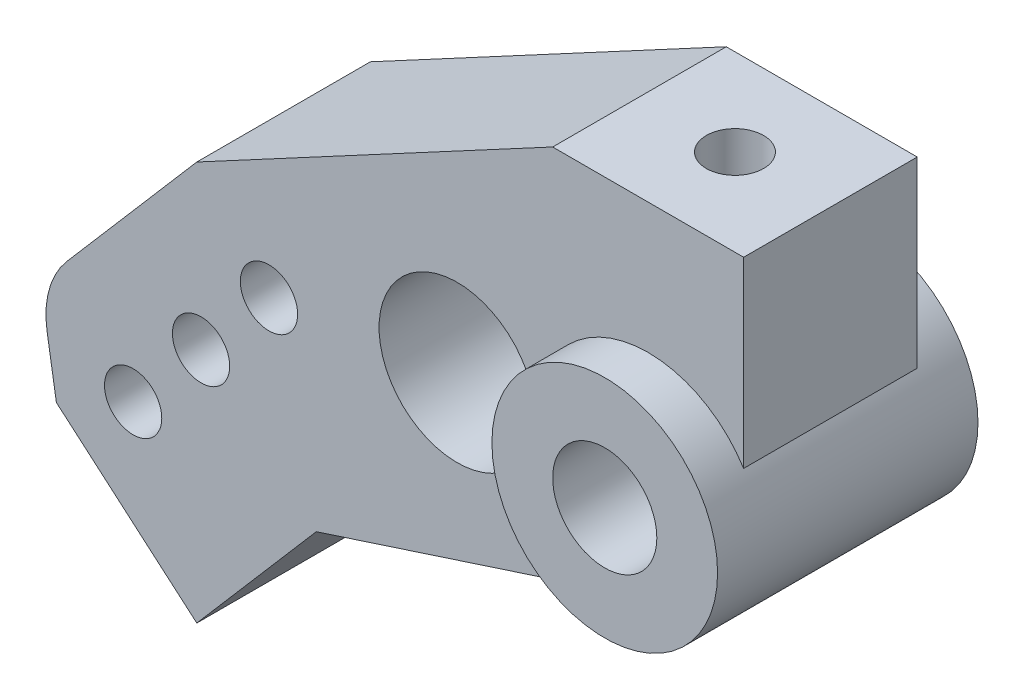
ISO-10303-21;
HEADER;
FILE_DESCRIPTION(('STEP AP214'),'2;1');
FILE_NAME('part.step','',(''),(''),'','','');
FILE_SCHEMA(('AUTOMOTIVE_DESIGN { 1 0 10303 214 1 1 1 1 }'));
ENDSEC;
DATA;
#1=APPLICATION_CONTEXT('core data for automotive mechanical design processes');
#2=APPLICATION_PROTOCOL_DEFINITION('international standard','automotive_design',2000,#1);
#3=PRODUCT_CONTEXT('',#1,'mechanical');
#4=PRODUCT('Part','Part','',(#3));
#5=PRODUCT_RELATED_PRODUCT_CATEGORY('part','',(#4));
#6=PRODUCT_DEFINITION_FORMATION('','',#4);
#7=PRODUCT_DEFINITION_CONTEXT('part definition',#1,'design');
#8=PRODUCT_DEFINITION('design','',#6,#7);
#9=PRODUCT_DEFINITION_SHAPE('','',#8);
#10=(LENGTH_UNIT() NAMED_UNIT(*) SI_UNIT(.MILLI.,.METRE.));
#11=(NAMED_UNIT(*) PLANE_ANGLE_UNIT() SI_UNIT($,.RADIAN.));
#12=(NAMED_UNIT(*) SI_UNIT($,.STERADIAN.) SOLID_ANGLE_UNIT());
#13=UNCERTAINTY_MEASURE_WITH_UNIT(LENGTH_MEASURE(1.E-05),#10,'distance_accuracy_value','');
#14=(GEOMETRIC_REPRESENTATION_CONTEXT(3) GLOBAL_UNCERTAINTY_ASSIGNED_CONTEXT((#13)) GLOBAL_UNIT_ASSIGNED_CONTEXT((#10,
#11,#12)) REPRESENTATION_CONTEXT('',''));
#15=CARTESIAN_POINT('',(0.,0.,0.));
#16=DIRECTION('',(0.,0.,1.));
#17=DIRECTION('',(1.,0.,0.));
#18=AXIS2_PLACEMENT_3D('',#15,#16,#17);
#19=CARTESIAN_POINT('',(0.,0.,-9.));
#20=DIRECTION('',(0.,0.,1.));
#21=DIRECTION('',(1.,0.,0.));
#22=AXIS2_PLACEMENT_3D('',#19,#20,#21);
#23=CYLINDRICAL_SURFACE('',#22,3.);
#24=CARTESIAN_POINT('',(0.,0.,-7.5));
#25=DIRECTION('',(0.,0.,1.));
#26=DIRECTION('',(1.,0.,0.));
#27=AXIS2_PLACEMENT_3D('',#24,#25,#26);
#28=CIRCLE('',#27,3.);
#29=CARTESIAN_POINT('',(3.,0.,-7.5));
#30=VERTEX_POINT('',#29);
#31=EDGE_CURVE('E212',#30,#30,#28,.F.);
#32=ORIENTED_EDGE('',*,*,#31,.T.);
#33=EDGE_LOOP('',(#32));
#34=FACE_BOUND('',#33,.T.);
#35=CARTESIAN_POINT('',(1.65,2.50549396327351,0.));
#36=CARTESIAN_POINT('',(1.64999602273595,2.50549963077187,-0.0846080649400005));
#37=CARTESIAN_POINT('',(1.64345134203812,2.50984420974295,-0.169248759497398));
#38=CARTESIAN_POINT('',(1.61767296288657,2.52653030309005,-0.335794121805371));
#39=CARTESIAN_POINT('',(1.59842443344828,2.53888116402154,-0.417695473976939));
#40=CARTESIAN_POINT('',(1.54839265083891,2.56969421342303,-0.576056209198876));
#41=CARTESIAN_POINT('',(1.51767883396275,2.58811953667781,-0.652545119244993));
#42=CARTESIAN_POINT('',(1.44580739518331,2.62894375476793,-0.799263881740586));
#43=CARTESIAN_POINT('',(1.40464664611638,2.65134383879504,-0.86949185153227));
#44=CARTESIAN_POINT('',(1.3081895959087,2.70034240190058,-1.0094935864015));
#45=CARTESIAN_POINT('',(1.25188532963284,2.7271364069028,-1.0785046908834));
#46=CARTESIAN_POINT('',(1.12882172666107,2.78033433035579,-1.20671606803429));
#47=CARTESIAN_POINT('',(1.06205629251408,2.80673801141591,-1.26591057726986));
#48=CARTESIAN_POINT('',(0.912983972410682,2.85888257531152,-1.37781284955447));
#49=CARTESIAN_POINT('',(0.829834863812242,2.88437187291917,-1.42952718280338));
#50=CARTESIAN_POINT('',(0.654349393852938,2.92916380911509,-1.51787796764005));
#51=CARTESIAN_POINT('',(0.562020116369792,2.94847117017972,-1.55452593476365));
#52=CARTESIAN_POINT('',(0.378923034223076,2.97729379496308,-1.60849393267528));
#53=CARTESIAN_POINT('',(0.288664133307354,2.98748996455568,-1.62716806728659));
#54=CARTESIAN_POINT('',(0.105769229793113,2.99953119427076,-1.6491747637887));
#55=CARTESIAN_POINT('',(0.013135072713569,3.00138255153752,-1.65251889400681));
#56=CARTESIAN_POINT('',(-0.161457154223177,2.99679125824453,-1.6441598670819));
#57=CARTESIAN_POINT('',(-0.243517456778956,2.99119677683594,-1.63399564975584));
#58=CARTESIAN_POINT('',(-0.404549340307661,2.97370133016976,-1.60174374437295));
#59=CARTESIAN_POINT('',(-0.483520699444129,2.9617999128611,-1.57965520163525));
#60=CARTESIAN_POINT('',(-0.63727968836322,2.93258787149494,-1.52418232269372));
#61=CARTESIAN_POINT('',(-0.712013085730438,2.915220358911,-1.49067886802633));
#62=CARTESIAN_POINT('',(-0.854942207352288,2.87655407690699,-1.41356821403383));
#63=CARTESIAN_POINT('',(-0.923135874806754,2.85525407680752,-1.36995785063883));
#64=CARTESIAN_POINT('',(-1.05891254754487,2.80791974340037,-1.26851887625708));
#65=CARTESIAN_POINT('',(-1.12563747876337,2.78162257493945,-1.2096643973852));
#66=CARTESIAN_POINT('',(-1.24878655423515,2.72855986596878,-1.08208395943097));
#67=CARTESIAN_POINT('',(-1.30519861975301,2.70179381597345,-1.01334659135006));
#68=CARTESIAN_POINT('',(-1.41107411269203,2.64814890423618,-0.860666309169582));
#69=CARTESIAN_POINT('',(-1.45948497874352,2.62146854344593,-0.775916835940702));
#70=CARTESIAN_POINT('',(-1.54099433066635,2.57440711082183,-0.59780951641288));
#71=CARTESIAN_POINT('',(-1.57412522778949,2.55401273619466,-0.504470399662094));
#72=CARTESIAN_POINT('',(-1.61559572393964,2.52789315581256,-0.342076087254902));
#73=CARTESIAN_POINT('',(-1.62845002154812,2.51957413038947,-0.274571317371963));
#74=CARTESIAN_POINT('',(-1.64565179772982,2.50837349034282,-0.138051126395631));
#75=CARTESIAN_POINT('',(-1.65000324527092,2.50548933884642,-0.0690364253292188));
#76=CARTESIAN_POINT('',(-1.64999602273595,2.50549963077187,0.0846080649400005));
#77=CARTESIAN_POINT('',(-1.64345134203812,2.50984420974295,0.169248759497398));
#78=CARTESIAN_POINT('',(-1.61767296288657,2.52653030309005,0.335794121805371));
#79=CARTESIAN_POINT('',(-1.59842443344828,2.53888116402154,0.417695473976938));
#80=CARTESIAN_POINT('',(-1.54839265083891,2.56969421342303,0.576056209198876));
#81=CARTESIAN_POINT('',(-1.51767883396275,2.58811953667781,0.652545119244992));
#82=CARTESIAN_POINT('',(-1.44580739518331,2.62894375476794,0.799263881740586));
#83=CARTESIAN_POINT('',(-1.40464664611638,2.65134383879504,0.86949185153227));
#84=CARTESIAN_POINT('',(-1.3081895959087,2.70034240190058,1.0094935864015));
#85=CARTESIAN_POINT('',(-1.25188532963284,2.7271364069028,1.0785046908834));
#86=CARTESIAN_POINT('',(-1.12882172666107,2.78033433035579,1.20671606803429));
#87=CARTESIAN_POINT('',(-1.06205629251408,2.80673801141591,1.26591057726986));
#88=CARTESIAN_POINT('',(-0.912983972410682,2.85888257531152,1.37781284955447));
#89=CARTESIAN_POINT('',(-0.829834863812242,2.88437187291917,1.42952718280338));
#90=CARTESIAN_POINT('',(-0.654349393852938,2.92916380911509,1.51787796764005));
#91=CARTESIAN_POINT('',(-0.562020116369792,2.94847117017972,1.55452593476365));
#92=CARTESIAN_POINT('',(-0.378923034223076,2.97729379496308,1.60849393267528));
#93=CARTESIAN_POINT('',(-0.288664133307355,2.98748996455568,1.62716806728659));
#94=CARTESIAN_POINT('',(-0.105769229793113,2.99953119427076,1.6491747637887));
#95=CARTESIAN_POINT('',(-0.0131350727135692,3.00138255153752,1.65251889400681));
#96=CARTESIAN_POINT('',(0.161457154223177,2.99679125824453,1.6441598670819));
#97=CARTESIAN_POINT('',(0.243517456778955,2.99119677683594,1.63399564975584));
#98=CARTESIAN_POINT('',(0.40454934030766,2.97370133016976,1.60174374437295));
#99=CARTESIAN_POINT('',(0.483520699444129,2.9617999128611,1.57965520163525));
#100=CARTESIAN_POINT('',(0.63727968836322,2.93258787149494,1.52418232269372));
#101=CARTESIAN_POINT('',(0.712013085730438,2.915220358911,1.49067886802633));
#102=CARTESIAN_POINT('',(0.854942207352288,2.87655407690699,1.41356821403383));
#103=CARTESIAN_POINT('',(0.923135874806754,2.85525407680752,1.36995785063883));
#104=CARTESIAN_POINT('',(1.05891254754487,2.80791974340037,1.26851887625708));
#105=CARTESIAN_POINT('',(1.12563747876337,2.78162257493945,1.2096643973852));
#106=CARTESIAN_POINT('',(1.24878655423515,2.72855986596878,1.08208395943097));
#107=CARTESIAN_POINT('',(1.30519861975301,2.70179381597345,1.01334659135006));
#108=CARTESIAN_POINT('',(1.41107411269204,2.64814890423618,0.860666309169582));
#109=CARTESIAN_POINT('',(1.45948497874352,2.62146854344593,0.775916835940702));
#110=CARTESIAN_POINT('',(1.54099433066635,2.57440711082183,0.59780951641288));
#111=CARTESIAN_POINT('',(1.57412522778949,2.55401273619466,0.504470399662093));
#112=CARTESIAN_POINT('',(1.61559572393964,2.52789315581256,0.342076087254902));
#113=CARTESIAN_POINT('',(1.62845002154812,2.51957413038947,0.274571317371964));
#114=CARTESIAN_POINT('',(1.64565179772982,2.50837349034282,0.138051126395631));
#115=CARTESIAN_POINT('',(1.65000324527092,2.50548933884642,0.069036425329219));
#116=CARTESIAN_POINT('',(1.65,2.50549396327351,0.));
#117=B_SPLINE_CURVE_WITH_KNOTS('',3,(#35,#36,#37,#38,#39,#40,#41,#42,#43,#44,#45,#46,#47,#48,
#49,#50,#51,#52,#53,#54,#55,#56,#57,#58,#59,#60,#61,#62,#63,#64,#65,#66,#67,#68,#69,#70,#71,#72,
#73,#74,#75,#76,#77,#78,#79,#80,#81,#82,#83,#84,#85,#86,#87,#88,#89,#90,#91,#92,#93,#94,#95,#96,
#97,#98,#99,#100,#101,#102,#103,#104,#105,#106,#107,#108,#109,#110,#111,#112,#113,#114,#115,
#116),.UNSPECIFIED.,.T.,.F.,(4,2,2,2,2,2,2,2,2,2,2,2,2,2,2,2,2,2,2,2,2,2,2,2,2,2,2,2,2,2,2,2,2,
2,2,2,2,2,2,2,4),(0.,0.253537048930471,0.50737061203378,0.7596912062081,1.0120874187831,
1.28998237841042,1.56803992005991,1.86997314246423,2.17167516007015,2.44828228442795,
2.7246806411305,2.97213724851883,3.21961159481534,3.46975180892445,3.71997043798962,
3.99715899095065,4.27467014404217,4.57667171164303,4.87802970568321,5.08500131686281,
5.29187629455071,5.54541334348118,5.79924690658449,6.0515675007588,6.3039637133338,
6.58185867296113,6.85991621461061,7.16184943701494,7.46355145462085,7.74015857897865,
8.01655693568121,8.26401354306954,8.51148788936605,8.76162810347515,9.01184673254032,
9.28903528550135,9.56654643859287,9.86854800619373,10.1699060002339,10.3768776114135,
10.5837525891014),.UNSPECIFIED.);
#118=CARTESIAN_POINT('',(1.65,2.50549396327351,0.));
#119=VERTEX_POINT('',#118);
#120=EDGE_CURVE('E117',#119,#119,#117,.T.);
#121=ORIENTED_EDGE('',*,*,#120,.T.);
#122=EDGE_LOOP('',(#121));
#123=FACE_BOUND('',#122,.T.);
#124=CARTESIAN_POINT('',(0.,0.,7.5));
#125=DIRECTION('',(0.,0.,1.));
#126=DIRECTION('',(1.,0.,0.));
#127=AXIS2_PLACEMENT_3D('',#124,#125,#126);
#128=CIRCLE('',#127,3.);
#129=CARTESIAN_POINT('',(3.,0.,7.5));
#130=VERTEX_POINT('',#129);
#131=EDGE_CURVE('E20',#130,#130,#128,.F.);
#132=ORIENTED_EDGE('',*,*,#131,.F.);
#133=EDGE_LOOP('',(#132));
#134=FACE_BOUND('',#133,.T.);
#135=ADVANCED_FACE('F16',(#34,#123,#134),#23,.F.);
#136=CARTESIAN_POINT('',(0.,0.,7.5));
#137=DIRECTION('',(0.,0.,1.));
#138=DIRECTION('',(1.,0.,0.));
#139=AXIS2_PLACEMENT_3D('',#136,#137,#138);
#140=PLANE('',#139);
#141=ORIENTED_EDGE('',*,*,#131,.T.);
#142=EDGE_LOOP('',(#141));
#143=FACE_BOUND('',#142,.T.);
#144=CARTESIAN_POINT('',(0.,0.,7.5));
#145=DIRECTION('',(0.,0.,1.));
#146=DIRECTION('',(1.,0.,0.));
#147=AXIS2_PLACEMENT_3D('',#144,#145,#146);
#148=CIRCLE('',#147,6.5);
#149=CARTESIAN_POINT('',(6.5,0.,7.5));
#150=VERTEX_POINT('',#149);
#151=EDGE_CURVE('E195',#150,#150,#148,.F.);
#152=ORIENTED_EDGE('',*,*,#151,.F.);
#153=EDGE_LOOP('',(#152));
#154=FACE_BOUND('',#153,.T.);
#155=ADVANCED_FACE('F445',(#143,#154),#140,.T.);
#156=CARTESIAN_POINT('',(0.,0.,-7.5));
#157=DIRECTION('',(0.,0.,1.));
#158=DIRECTION('',(1.,0.,0.));
#159=AXIS2_PLACEMENT_3D('',#156,#157,#158);
#160=PLANE('',#159);
#161=ORIENTED_EDGE('',*,*,#31,.F.);
#162=EDGE_LOOP('',(#161));
#163=FACE_BOUND('',#162,.T.);
#164=CARTESIAN_POINT('',(0.,0.,-7.5));
#165=DIRECTION('',(0.,0.,1.));
#166=DIRECTION('',(1.,0.,0.));
#167=AXIS2_PLACEMENT_3D('',#164,#165,#166);
#168=CIRCLE('',#167,6.5);
#169=CARTESIAN_POINT('',(6.5,0.,-7.5));
#170=VERTEX_POINT('',#169);
#171=EDGE_CURVE('E146',#170,#170,#168,.T.);
#172=ORIENTED_EDGE('',*,*,#171,.F.);
#173=EDGE_LOOP('',(#172));
#174=FACE_BOUND('',#173,.T.);
#175=ADVANCED_FACE('F220',(#163,#174),#160,.F.);
#176=CARTESIAN_POINT('',(0.,0.,0.));
#177=DIRECTION('',(0.,1.,0.));
#178=DIRECTION('',(0.,0.,1.));
#179=AXIS2_PLACEMENT_3D('',#176,#177,#178);
#180=CYLINDRICAL_SURFACE('',#179,1.65);
#181=CARTESIAN_POINT('',(0.,14.,0.));
#182=DIRECTION('',(0.,1.,0.));
#183=DIRECTION('',(0.,0.,1.));
#184=AXIS2_PLACEMENT_3D('',#181,#182,#183);
#185=CIRCLE('',#184,1.65);
#186=CARTESIAN_POINT('',(0.,14.,1.65));
#187=VERTEX_POINT('',#186);
#188=EDGE_CURVE('E135',#187,#187,#185,.F.);
#189=ORIENTED_EDGE('',*,*,#188,.F.);
#190=EDGE_LOOP('',(#189));
#191=FACE_BOUND('',#190,.T.);
#192=ORIENTED_EDGE('',*,*,#120,.F.);
#193=EDGE_LOOP('',(#192));
#194=FACE_BOUND('',#193,.T.);
#195=ADVANCED_FACE('F215',(#191,#194),#180,.F.);
#196=CARTESIAN_POINT('',(0.,0.,5.));
#197=DIRECTION('',(0.,0.,1.));
#198=DIRECTION('',(1.,0.,0.));
#199=AXIS2_PLACEMENT_3D('',#196,#197,#198);
#200=PLANE('',#199);
#201=CARTESIAN_POINT('',(-21.84089222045,-1.695364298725,5.));
#202=DIRECTION('',(0.,0.,1.));
#203=DIRECTION('',(1.,0.,0.));
#204=AXIS2_PLACEMENT_3D('',#201,#202,#203);
#205=CIRCLE('',#204,1.65);
#206=CARTESIAN_POINT('',(-20.19089222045,-1.695364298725,5.));
#207=VERTEX_POINT('',#206);
#208=EDGE_CURVE('E181',#207,#207,#205,.F.);
#209=ORIENTED_EDGE('',*,*,#208,.T.);
#210=EDGE_LOOP('',(#209));
#211=FACE_BOUND('',#210,.T.);
#212=CARTESIAN_POINT('',(-25.75393569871,-6.243780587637,5.));
#213=DIRECTION('',(0.,0.,1.));
#214=DIRECTION('',(1.,0.,0.));
#215=AXIS2_PLACEMENT_3D('',#212,#213,#214);
#216=CIRCLE('',#215,1.65);
#217=CARTESIAN_POINT('',(-24.10393569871,-6.243780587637,5.));
#218=VERTEX_POINT('',#217);
#219=EDGE_CURVE('E184',#218,#218,#216,.F.);
#220=ORIENTED_EDGE('',*,*,#219,.T.);
#221=EDGE_LOOP('',(#220));
#222=FACE_BOUND('',#221,.T.);
#223=CARTESIAN_POINT('',(-29.66697917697,-10.79219687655,5.));
#224=DIRECTION('',(0.,0.,1.));
#225=DIRECTION('',(1.,0.,0.));
#226=AXIS2_PLACEMENT_3D('',#223,#224,#225);
#227=CIRCLE('',#226,1.65);
#228=CARTESIAN_POINT('',(-28.01697917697,-10.79219687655,5.));
#229=VERTEX_POINT('',#228);
#230=EDGE_CURVE('E187',#229,#229,#227,.F.);
#231=ORIENTED_EDGE('',*,*,#230,.T.);
#232=EDGE_LOOP('',(#231));
#233=FACE_BOUND('',#232,.T.);
#234=DIRECTION('',(-0.652173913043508,-0.758069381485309,0.));
#235=VECTOR('',#234,1.);
#236=CARTESIAN_POINT('',(-26.,3.,5.));
#237=LINE('',#236,#235);
#238=CARTESIAN_POINT('',(-33.4794315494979,-5.69388967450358,5.));
#239=VERTEX_POINT('',#238);
#240=CARTESIAN_POINT('',(-26.,3.00000000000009,5.));
#241=VERTEX_POINT('',#240);
#242=EDGE_CURVE('E113',#239,#241,#237,.F.);
#243=ORIENTED_EDGE('',*,*,#242,.F.);
#244=CARTESIAN_POINT('',(-29.68908464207,-8.954759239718,5.));
#245=DIRECTION('',(0.,0.,-1.));
#246=DIRECTION('',(-1.,0.,0.));
#247=AXIS2_PLACEMENT_3D('',#244,#245,#246);
#248=CIRCLE('',#247,5.);
#249=CARTESIAN_POINT('',(-34.6234436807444,-9.76228687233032,5.));
#250=VERTEX_POINT('',#249);
#251=EDGE_CURVE('E107',#250,#239,#248,.T.);
#252=ORIENTED_EDGE('',*,*,#251,.F.);
#253=DIRECTION('',(0.161505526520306,-0.986871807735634,0.));
#254=VECTOR('',#253,1.);
#255=CARTESIAN_POINT('',(-35.,-7.461357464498,5.));
#256=LINE('',#255,#254);
#257=CARTESIAN_POINT('',(-34.0865274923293,-13.0430876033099,5.));
#258=VERTEX_POINT('',#257);
#259=EDGE_CURVE('E97',#258,#250,#256,.F.);
#260=ORIENTED_EDGE('',*,*,#259,.F.);
#261=DIRECTION('',(0.758069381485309,-0.652173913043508,0.));
#262=VECTOR('',#261,1.);
#263=CARTESIAN_POINT('',(-34.08652749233,-13.04308760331,5.));
#264=LINE('',#263,#262);
#265=CARTESIAN_POINT('',(-26.0000000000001,-20.0000000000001,5.));
#266=VERTEX_POINT('',#265);
#267=EDGE_CURVE('E122',#266,#258,#264,.F.);
#268=ORIENTED_EDGE('',*,*,#267,.F.);
#269=DIRECTION('',(0.652173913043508,0.758069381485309,0.));
#270=VECTOR('',#269,1.);
#271=CARTESIAN_POINT('',(-26.,-20.,5.));
#272=LINE('',#271,#270);
#273=CARTESIAN_POINT('',(-19.1175279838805,-11.9999999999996,5.));
#274=VERTEX_POINT('',#273);
#275=EDGE_CURVE('E155',#274,#266,#272,.F.);
#276=ORIENTED_EDGE('',*,*,#275,.F.);
#277=DIRECTION('',(0.950985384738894,0.309235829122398,0.));
#278=VECTOR('',#277,1.);
#279=CARTESIAN_POINT('',(-19.11752798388,-12.,5.));
#280=LINE('',#279,#278);
#281=CARTESIAN_POINT('',(-1.5935129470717,-6.30164395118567,5.));
#282=VERTEX_POINT('',#281);
#283=EDGE_CURVE('E149',#282,#274,#280,.F.);
#284=ORIENTED_EDGE('',*,*,#283,.F.);
#285=CARTESIAN_POINT('',(0.,0.,5.));
#286=DIRECTION('',(0.,0.,1.));
#287=DIRECTION('',(1.,0.,0.));
#288=AXIS2_PLACEMENT_3D('',#285,#286,#287);
#289=CIRCLE('',#288,6.5);
#290=CARTESIAN_POINT('',(-6.5,0.,5.));
#291=VERTEX_POINT('',#290);
#292=EDGE_CURVE('E205',#291,#282,#289,.T.);
#293=ORIENTED_EDGE('',*,*,#292,.F.);
#294=CARTESIAN_POINT('',(-11.,0.,5.));
#295=DIRECTION('',(0.,0.,1.));
#296=DIRECTION('',(1.,0.,0.));
#297=AXIS2_PLACEMENT_3D('',#294,#295,#296);
#298=CIRCLE('',#297,4.5);
#299=EDGE_CURVE('E201',#291,#291,#298,.F.);
#300=ORIENTED_EDGE('',*,*,#299,.T.);
#301=CARTESIAN_POINT('',(0.,0.,5.));
#302=DIRECTION('',(0.,0.,1.));
#303=DIRECTION('',(1.,0.,0.));
#304=AXIS2_PLACEMENT_3D('',#301,#302,#303);
#305=CIRCLE('',#304,6.5);
#306=CARTESIAN_POINT('',(5.5,3.46410161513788,5.));
#307=VERTEX_POINT('',#306);
#308=EDGE_CURVE('E198',#307,#291,#305,.T.);
#309=ORIENTED_EDGE('',*,*,#308,.F.);
#310=DIRECTION('',(0.,1.,0.));
#311=VECTOR('',#310,1.);
#312=CARTESIAN_POINT('',(5.5,0.,5.));
#313=LINE('',#312,#311);
#314=CARTESIAN_POINT('',(5.5,14.,5.));
#315=VERTEX_POINT('',#314);
#316=EDGE_CURVE('E144',#315,#307,#313,.F.);
#317=ORIENTED_EDGE('',*,*,#316,.F.);
#318=DIRECTION('',(1.,0.,0.));
#319=VECTOR('',#318,1.);
#320=CARTESIAN_POINT('',(5.5,14.,5.));
#321=LINE('',#320,#319);
#322=CARTESIAN_POINT('',(-5.5,14.,5.));
#323=VERTEX_POINT('',#322);
#324=EDGE_CURVE('E138',#323,#315,#321,.T.);
#325=ORIENTED_EDGE('',*,*,#324,.F.);
#326=DIRECTION('',(-0.881160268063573,-0.472817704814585,0.));
#327=VECTOR('',#326,1.);
#328=CARTESIAN_POINT('',(-5.5,14.,5.));
#329=LINE('',#328,#327);
#330=EDGE_CURVE('E133',#241,#323,#329,.F.);
#331=ORIENTED_EDGE('',*,*,#330,.F.);
#332=EDGE_LOOP('',(#243,#252,#260,#268,#276,#284,#293,#300,#309,#317,#325,#331));
#333=FACE_BOUND('',#332,.T.);
#334=ADVANCED_FACE('F111',(#211,#222,#233,#333),#200,.T.);
#335=CARTESIAN_POINT('',(-29.68908464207,-8.954759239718,27.054));
#336=DIRECTION('',(0.,0.,-1.));
#337=DIRECTION('',(-1.,0.,0.));
#338=AXIS2_PLACEMENT_3D('',#335,#336,#337);
#339=CYLINDRICAL_SURFACE('',#338,5.);
#340=DIRECTION('',(0.,0.,1.));
#341=VECTOR('',#340,1.);
#342=CARTESIAN_POINT('',(-33.4794315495,-5.69388967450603,-5.));
#343=LINE('',#342,#341);
#344=CARTESIAN_POINT('',(-33.4794315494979,-5.69388967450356,-5.));
#345=VERTEX_POINT('',#344);
#346=EDGE_CURVE('E190',#345,#239,#343,.T.);
#347=ORIENTED_EDGE('',*,*,#346,.F.);
#348=CARTESIAN_POINT('',(-29.68908464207,-8.954759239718,-5.));
#349=DIRECTION('',(0.,0.,-1.));
#350=DIRECTION('',(-1.,0.,0.));
#351=AXIS2_PLACEMENT_3D('',#348,#349,#350);
#352=CIRCLE('',#351,5.);
#353=CARTESIAN_POINT('',(-34.6234436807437,-9.76228687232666,-5.));
#354=VERTEX_POINT('',#353);
#355=EDGE_CURVE('E121',#345,#354,#352,.F.);
#356=ORIENTED_EDGE('',*,*,#355,.T.);
#357=DIRECTION('',(0.,0.,1.));
#358=VECTOR('',#357,1.);
#359=CARTESIAN_POINT('',(-34.6234436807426,-9.76228687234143,-5.));
#360=LINE('',#359,#358);
#361=EDGE_CURVE('E102',#250,#354,#360,.F.);
#362=ORIENTED_EDGE('',*,*,#361,.F.);
#363=ORIENTED_EDGE('',*,*,#251,.T.);
#364=EDGE_LOOP('',(#347,#356,#362,#363));
#365=FACE_BOUND('',#364,.T.);
#366=ADVANCED_FACE('F120',(#365),#339,.T.);
#367=CARTESIAN_POINT('',(-35.,-7.461357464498,-5.));
#368=DIRECTION('',(-0.986871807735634,-0.161505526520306,0.));
#369=DIRECTION('',(0.161505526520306,-0.986871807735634,0.));
#370=AXIS2_PLACEMENT_3D('',#367,#368,#369);
#371=PLANE('',#370);
#372=ORIENTED_EDGE('',*,*,#259,.T.);
#373=ORIENTED_EDGE('',*,*,#361,.T.);
#374=DIRECTION('',(0.161505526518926,-0.98687180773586,0.));
#375=VECTOR('',#374,1.);
#376=CARTESIAN_POINT('',(-34.62344368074,-9.762286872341,-5.));
#377=LINE('',#376,#375);
#378=CARTESIAN_POINT('',(-34.08652749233,-13.04308760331,-5.));
#379=VERTEX_POINT('',#378);
#380=EDGE_CURVE('E180',#354,#379,#377,.T.);
#381=ORIENTED_EDGE('',*,*,#380,.T.);
#382=DIRECTION('',(0.,0.,1.));
#383=VECTOR('',#382,1.);
#384=CARTESIAN_POINT('',(-34.08652749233,-13.04308760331,-5.));
#385=LINE('',#384,#383);
#386=EDGE_CURVE('E104',#258,#379,#385,.F.);
#387=ORIENTED_EDGE('',*,*,#386,.F.);
#388=EDGE_LOOP('',(#372,#373,#381,#387));
#389=FACE_BOUND('',#388,.T.);
#390=ADVANCED_FACE('F99',(#389),#371,.T.);
#391=CARTESIAN_POINT('',(-34.08652749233,-13.04308760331,-5.));
#392=DIRECTION('',(-0.652173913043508,-0.758069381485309,0.));
#393=DIRECTION('',(0.758069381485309,-0.652173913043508,0.));
#394=AXIS2_PLACEMENT_3D('',#391,#392,#393);
#395=PLANE('',#394);
#396=ORIENTED_EDGE('',*,*,#386,.T.);
#397=DIRECTION('',(0.758069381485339,-0.652173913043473,0.));
#398=VECTOR('',#397,1.);
#399=CARTESIAN_POINT('',(-34.08652749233,-13.04308760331,-5.));
#400=LINE('',#399,#398);
#401=CARTESIAN_POINT('',(-26.,-20.,-5.));
#402=VERTEX_POINT('',#401);
#403=EDGE_CURVE('E318',#379,#402,#400,.T.);
#404=ORIENTED_EDGE('',*,*,#403,.T.);
#405=DIRECTION('',(0.,0.,1.));
#406=VECTOR('',#405,1.);
#407=CARTESIAN_POINT('',(-26.,-20.,-5.));
#408=LINE('',#407,#406);
#409=EDGE_CURVE('E152',#266,#402,#408,.F.);
#410=ORIENTED_EDGE('',*,*,#409,.F.);
#411=ORIENTED_EDGE('',*,*,#267,.T.);
#412=EDGE_LOOP('',(#396,#404,#410,#411));
#413=FACE_BOUND('',#412,.T.);
#414=ADVANCED_FACE('F229',(#413),#395,.T.);
#415=CARTESIAN_POINT('',(-26.,-20.,-5.));
#416=DIRECTION('',(0.758069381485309,-0.652173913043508,0.));
#417=DIRECTION('',(0.652173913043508,0.758069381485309,0.));
#418=AXIS2_PLACEMENT_3D('',#415,#416,#417);
#419=PLANE('',#418);
#420=ORIENTED_EDGE('',*,*,#409,.T.);
#421=DIRECTION('',(0.65217391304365,0.758069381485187,0.));
#422=VECTOR('',#421,1.);
#423=CARTESIAN_POINT('',(-26.,-20.,-5.));
#424=LINE('',#423,#422);
#425=CARTESIAN_POINT('',(-19.11752798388,-12.,-5.));
#426=VERTEX_POINT('',#425);
#427=EDGE_CURVE('E315',#402,#426,#424,.T.);
#428=ORIENTED_EDGE('',*,*,#427,.T.);
#429=DIRECTION('',(0.,0.,1.));
#430=VECTOR('',#429,1.);
#431=CARTESIAN_POINT('',(-19.11752798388,-12.,-5.));
#432=LINE('',#431,#430);
#433=EDGE_CURVE('E151',#274,#426,#432,.F.);
#434=ORIENTED_EDGE('',*,*,#433,.F.);
#435=ORIENTED_EDGE('',*,*,#275,.T.);
#436=EDGE_LOOP('',(#420,#428,#434,#435));
#437=FACE_BOUND('',#436,.T.);
#438=ADVANCED_FACE('F232',(#437),#419,.T.);
#439=CARTESIAN_POINT('',(-19.11752798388,-12.,-5.));
#440=DIRECTION('',(0.309235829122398,-0.950985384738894,0.));
#441=DIRECTION('',(0.950985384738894,0.309235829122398,0.));
#442=AXIS2_PLACEMENT_3D('',#439,#440,#441);
#443=PLANE('',#442);
#444=DIRECTION('',(0.950985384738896,0.309235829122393,0.));
#445=VECTOR('',#444,1.);
#446=CARTESIAN_POINT('',(-19.11752798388,-12.,-5.));
#447=LINE('',#446,#445);
#448=CARTESIAN_POINT('',(-1.5935129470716,-6.30164395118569,-5.));
#449=VERTEX_POINT('',#448);
#450=EDGE_CURVE('E178',#426,#449,#447,.T.);
#451=ORIENTED_EDGE('',*,*,#450,.T.);
#452=DIRECTION('',(0.,0.,1.));
#453=VECTOR('',#452,1.);
#454=CARTESIAN_POINT('',(-1.59351294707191,-6.30164395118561,-7.5));
#455=LINE('',#454,#453);
#456=EDGE_CURVE('E204',#282,#449,#455,.F.);
#457=ORIENTED_EDGE('',*,*,#456,.F.);
#458=ORIENTED_EDGE('',*,*,#283,.T.);
#459=ORIENTED_EDGE('',*,*,#433,.T.);
#460=EDGE_LOOP('',(#451,#457,#458,#459));
#461=FACE_BOUND('',#460,.T.);
#462=ADVANCED_FACE('F236',(#461),#443,.T.);
#463=CARTESIAN_POINT('',(-11.,0.,-9.));
#464=DIRECTION('',(0.,0.,1.));
#465=DIRECTION('',(1.,0.,0.));
#466=AXIS2_PLACEMENT_3D('',#463,#464,#465);
#467=CYLINDRICAL_SURFACE('',#466,4.5);
#468=ORIENTED_EDGE('',*,*,#299,.F.);
#469=EDGE_LOOP('',(#468));
#470=FACE_BOUND('',#469,.T.);
#471=CARTESIAN_POINT('',(-11.,0.,-5.));
#472=DIRECTION('',(0.,0.,1.));
#473=DIRECTION('',(1.,0.,0.));
#474=AXIS2_PLACEMENT_3D('',#471,#472,#473);
#475=CIRCLE('',#474,4.5);
#476=CARTESIAN_POINT('',(-6.5,0.,-5.));
#477=VERTEX_POINT('',#476);
#478=EDGE_CURVE('E173',#477,#477,#475,.F.);
#479=ORIENTED_EDGE('',*,*,#478,.T.);
#480=EDGE_LOOP('',(#479));
#481=FACE_BOUND('',#480,.T.);
#482=ADVANCED_FACE('F240',(#470,#481),#467,.F.);
#483=CARTESIAN_POINT('',(0.,0.,-7.5));
#484=DIRECTION('',(0.,0.,1.));
#485=DIRECTION('',(1.,0.,0.));
#486=AXIS2_PLACEMENT_3D('',#483,#484,#485);
#487=CYLINDRICAL_SURFACE('',#486,6.5);
#488=ORIENTED_EDGE('',*,*,#151,.T.);
#489=EDGE_LOOP('',(#488));
#490=FACE_BOUND('',#489,.T.);
#491=ORIENTED_EDGE('',*,*,#171,.T.);
#492=EDGE_LOOP('',(#491));
#493=FACE_BOUND('',#492,.T.);
#494=ORIENTED_EDGE('',*,*,#308,.T.);
#495=ORIENTED_EDGE('',*,*,#292,.T.);
#496=ORIENTED_EDGE('',*,*,#456,.T.);
#497=CARTESIAN_POINT('',(0.,0.,-5.));
#498=DIRECTION('',(0.,0.,1.));
#499=DIRECTION('',(1.,0.,0.));
#500=AXIS2_PLACEMENT_3D('',#497,#498,#499);
#501=CIRCLE('',#500,6.5);
#502=EDGE_CURVE('E175',#449,#477,#501,.F.);
#503=ORIENTED_EDGE('',*,*,#502,.T.);
#504=CARTESIAN_POINT('',(0.,0.,-5.));
#505=DIRECTION('',(0.,0.,1.));
#506=DIRECTION('',(1.,0.,0.));
#507=AXIS2_PLACEMENT_3D('',#504,#505,#506);
#508=CIRCLE('',#507,6.5);
#509=CARTESIAN_POINT('',(5.5,3.46410161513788,-5.));
#510=VERTEX_POINT('',#509);
#511=EDGE_CURVE('E169',#477,#510,#508,.F.);
#512=ORIENTED_EDGE('',*,*,#511,.T.);
#513=DIRECTION('',(0.,0.,-1.));
#514=VECTOR('',#513,1.);
#515=CARTESIAN_POINT('',(5.5,3.464101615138,-5.));
#516=LINE('',#515,#514);
#517=EDGE_CURVE('E141',#307,#510,#516,.T.);
#518=ORIENTED_EDGE('',*,*,#517,.F.);
#519=EDGE_LOOP('',(#494,#495,#496,#503,#512,#518));
#520=FACE_BOUND('',#519,.T.);
#521=ADVANCED_FACE('F244',(#490,#493,#520),#487,.T.);
#522=CARTESIAN_POINT('',(5.5,0.,-5.));
#523=DIRECTION('',(1.,0.,0.));
#524=DIRECTION('',(0.,0.,-1.));
#525=AXIS2_PLACEMENT_3D('',#522,#523,#524);
#526=PLANE('',#525);
#527=ORIENTED_EDGE('',*,*,#316,.T.);
#528=ORIENTED_EDGE('',*,*,#517,.T.);
#529=DIRECTION('',(0.,1.,0.));
#530=VECTOR('',#529,1.);
#531=CARTESIAN_POINT('',(5.5,0.,-5.));
#532=LINE('',#531,#530);
#533=CARTESIAN_POINT('',(5.5,14.,-5.));
#534=VERTEX_POINT('',#533);
#535=EDGE_CURVE('E172',#510,#534,#532,.T.);
#536=ORIENTED_EDGE('',*,*,#535,.T.);
#537=DIRECTION('',(0.,0.,1.));
#538=VECTOR('',#537,1.);
#539=CARTESIAN_POINT('',(5.5,14.,-5.));
#540=LINE('',#539,#538);
#541=EDGE_CURVE('E140',#315,#534,#540,.F.);
#542=ORIENTED_EDGE('',*,*,#541,.F.);
#543=EDGE_LOOP('',(#527,#528,#536,#542));
#544=FACE_BOUND('',#543,.T.);
#545=ADVANCED_FACE('F248',(#544),#526,.T.);
#546=CARTESIAN_POINT('',(5.5,14.,-5.));
#547=DIRECTION('',(0.,1.,0.));
#548=DIRECTION('',(0.,0.,1.));
#549=AXIS2_PLACEMENT_3D('',#546,#547,#548);
#550=PLANE('',#549);
#551=ORIENTED_EDGE('',*,*,#188,.T.);
#552=EDGE_LOOP('',(#551));
#553=FACE_BOUND('',#552,.T.);
#554=ORIENTED_EDGE('',*,*,#541,.T.);
#555=DIRECTION('',(1.,0.,0.));
#556=VECTOR('',#555,1.);
#557=CARTESIAN_POINT('',(0.,14.,-5.));
#558=LINE('',#557,#556);
#559=CARTESIAN_POINT('',(-5.5,14.,-5.));
#560=VERTEX_POINT('',#559);
#561=EDGE_CURVE('E293',#534,#560,#558,.F.);
#562=ORIENTED_EDGE('',*,*,#561,.T.);
#563=DIRECTION('',(0.,0.,1.));
#564=VECTOR('',#563,1.);
#565=CARTESIAN_POINT('',(-5.5,14.,-5.));
#566=LINE('',#565,#564);
#567=EDGE_CURVE('E130',#323,#560,#566,.F.);
#568=ORIENTED_EDGE('',*,*,#567,.F.);
#569=ORIENTED_EDGE('',*,*,#324,.T.);
#570=EDGE_LOOP('',(#554,#562,#568,#569));
#571=FACE_BOUND('',#570,.T.);
#572=ADVANCED_FACE('F252',(#553,#571),#550,.T.);
#573=CARTESIAN_POINT('',(-5.5,14.,-5.));
#574=DIRECTION('',(-0.472817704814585,0.881160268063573,0.));
#575=DIRECTION('',(-0.881160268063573,-0.472817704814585,0.));
#576=AXIS2_PLACEMENT_3D('',#573,#574,#575);
#577=PLANE('',#576);
#578=ORIENTED_EDGE('',*,*,#567,.T.);
#579=DIRECTION('',(-0.881160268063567,-0.472817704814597,0.));
#580=VECTOR('',#579,1.);
#581=CARTESIAN_POINT('',(-5.5,14.,-5.));
#582=LINE('',#581,#580);
#583=CARTESIAN_POINT('',(-26.,3.00000000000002,-5.));
#584=VERTEX_POINT('',#583);
#585=EDGE_CURVE('E290',#560,#584,#582,.T.);
#586=ORIENTED_EDGE('',*,*,#585,.T.);
#587=DIRECTION('',(0.,0.,1.));
#588=VECTOR('',#587,1.);
#589=CARTESIAN_POINT('',(-26.,3.,-5.));
#590=LINE('',#589,#588);
#591=EDGE_CURVE('E35',#241,#584,#590,.F.);
#592=ORIENTED_EDGE('',*,*,#591,.F.);
#593=ORIENTED_EDGE('',*,*,#330,.T.);
#594=EDGE_LOOP('',(#578,#586,#592,#593));
#595=FACE_BOUND('',#594,.T.);
#596=ADVANCED_FACE('F256',(#595),#577,.T.);
#597=CARTESIAN_POINT('',(-26.,3.,-5.));
#598=DIRECTION('',(-0.758069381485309,0.652173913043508,0.));
#599=DIRECTION('',(-0.652173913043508,-0.758069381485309,0.));
#600=AXIS2_PLACEMENT_3D('',#597,#598,#599);
#601=PLANE('',#600);
#602=DIRECTION('',(-0.652173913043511,-0.758069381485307,0.));
#603=VECTOR('',#602,1.);
#604=CARTESIAN_POINT('',(-26.,3.,-5.));
#605=LINE('',#604,#603);
#606=EDGE_CURVE('E168',#584,#345,#605,.T.);
#607=ORIENTED_EDGE('',*,*,#606,.T.);
#608=ORIENTED_EDGE('',*,*,#346,.T.);
#609=ORIENTED_EDGE('',*,*,#242,.T.);
#610=ORIENTED_EDGE('',*,*,#591,.T.);
#611=EDGE_LOOP('',(#607,#608,#609,#610));
#612=FACE_BOUND('',#611,.T.);
#613=ADVANCED_FACE('F260',(#612),#601,.T.);
#614=CARTESIAN_POINT('',(-29.66697917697,-10.79219687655,-9.));
#615=DIRECTION('',(0.,0.,1.));
#616=DIRECTION('',(1.,0.,0.));
#617=AXIS2_PLACEMENT_3D('',#614,#615,#616);
#618=CYLINDRICAL_SURFACE('',#617,1.65);
#619=ORIENTED_EDGE('',*,*,#230,.F.);
#620=EDGE_LOOP('',(#619));
#621=FACE_BOUND('',#620,.T.);
#622=CARTESIAN_POINT('',(-29.66697917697,-10.79219687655,-5.));
#623=DIRECTION('',(0.,0.,1.));
#624=DIRECTION('',(1.,0.,0.));
#625=AXIS2_PLACEMENT_3D('',#622,#623,#624);
#626=CIRCLE('',#625,1.65);
#627=CARTESIAN_POINT('',(-28.01697917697,-10.79219687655,-5.));
#628=VERTEX_POINT('',#627);
#629=EDGE_CURVE('E165',#628,#628,#626,.F.);
#630=ORIENTED_EDGE('',*,*,#629,.T.);
#631=EDGE_LOOP('',(#630));
#632=FACE_BOUND('',#631,.T.);
#633=ADVANCED_FACE('F264',(#621,#632),#618,.F.);
#634=CARTESIAN_POINT('',(-25.75393569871,-6.243780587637,-9.));
#635=DIRECTION('',(0.,0.,1.));
#636=DIRECTION('',(1.,0.,0.));
#637=AXIS2_PLACEMENT_3D('',#634,#635,#636);
#638=CYLINDRICAL_SURFACE('',#637,1.65);
#639=ORIENTED_EDGE('',*,*,#219,.F.);
#640=EDGE_LOOP('',(#639));
#641=FACE_BOUND('',#640,.T.);
#642=CARTESIAN_POINT('',(-25.75393569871,-6.243780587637,-5.));
#643=DIRECTION('',(0.,0.,1.));
#644=DIRECTION('',(1.,0.,0.));
#645=AXIS2_PLACEMENT_3D('',#642,#643,#644);
#646=CIRCLE('',#645,1.65);
#647=CARTESIAN_POINT('',(-24.10393569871,-6.243780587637,-5.));
#648=VERTEX_POINT('',#647);
#649=EDGE_CURVE('E26',#648,#648,#646,.F.);
#650=ORIENTED_EDGE('',*,*,#649,.T.);
#651=EDGE_LOOP('',(#650));
#652=FACE_BOUND('',#651,.T.);
#653=ADVANCED_FACE('F267',(#641,#652),#638,.F.);
#654=CARTESIAN_POINT('',(-21.84089222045,-1.695364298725,-9.));
#655=DIRECTION('',(0.,0.,1.));
#656=DIRECTION('',(1.,0.,0.));
#657=AXIS2_PLACEMENT_3D('',#654,#655,#656);
#658=CYLINDRICAL_SURFACE('',#657,1.65);
#659=ORIENTED_EDGE('',*,*,#208,.F.);
#660=EDGE_LOOP('',(#659));
#661=FACE_BOUND('',#660,.T.);
#662=CARTESIAN_POINT('',(-21.84089222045,-1.695364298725,-5.));
#663=DIRECTION('',(0.,0.,1.));
#664=DIRECTION('',(1.,0.,0.));
#665=AXIS2_PLACEMENT_3D('',#662,#663,#664);
#666=CIRCLE('',#665,1.65);
#667=CARTESIAN_POINT('',(-20.19089222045,-1.695364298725,-5.));
#668=VERTEX_POINT('',#667);
#669=EDGE_CURVE('E11',#668,#668,#666,.F.);
#670=ORIENTED_EDGE('',*,*,#669,.T.);
#671=EDGE_LOOP('',(#670));
#672=FACE_BOUND('',#671,.T.);
#673=ADVANCED_FACE('F270',(#661,#672),#658,.F.);
#674=CARTESIAN_POINT('',(0.,0.,-5.));
#675=DIRECTION('',(0.,0.,1.));
#676=DIRECTION('',(1.,0.,0.));
#677=AXIS2_PLACEMENT_3D('',#674,#675,#676);
#678=PLANE('',#677);
#679=ORIENTED_EDGE('',*,*,#669,.F.);
#680=EDGE_LOOP('',(#679));
#681=FACE_BOUND('',#680,.T.);
#682=ORIENTED_EDGE('',*,*,#649,.F.);
#683=EDGE_LOOP('',(#682));
#684=FACE_BOUND('',#683,.T.);
#685=ORIENTED_EDGE('',*,*,#629,.F.);
#686=EDGE_LOOP('',(#685));
#687=FACE_BOUND('',#686,.T.);
#688=ORIENTED_EDGE('',*,*,#585,.F.);
#689=ORIENTED_EDGE('',*,*,#561,.F.);
#690=ORIENTED_EDGE('',*,*,#535,.F.);
#691=ORIENTED_EDGE('',*,*,#511,.F.);
#692=ORIENTED_EDGE('',*,*,#478,.F.);
#693=ORIENTED_EDGE('',*,*,#502,.F.);
#694=ORIENTED_EDGE('',*,*,#450,.F.);
#695=ORIENTED_EDGE('',*,*,#427,.F.);
#696=ORIENTED_EDGE('',*,*,#403,.F.);
#697=ORIENTED_EDGE('',*,*,#380,.F.);
#698=ORIENTED_EDGE('',*,*,#355,.F.);
#699=ORIENTED_EDGE('',*,*,#606,.F.);
#700=EDGE_LOOP('',(#688,#689,#690,#691,#692,#693,#694,#695,#696,#697,#698,#699));
#701=FACE_BOUND('',#700,.T.);
#702=ADVANCED_FACE('F18',(#681,#684,#687,#701),#678,.F.);
#703=CLOSED_SHELL('',(#135,#155,#175,#195,#334,#366,#390,#414,#438,#462,#482,#521,#545,#572,
#596,#613,#633,#653,#673,#702));
#704=MANIFOLD_SOLID_BREP('B1',#703);
#705=ADVANCED_BREP_SHAPE_REPRESENTATION('',(#18,#704),#14);
#706=SHAPE_DEFINITION_REPRESENTATION(#9,#705);
ENDSEC;
END-ISO-10303-21;
